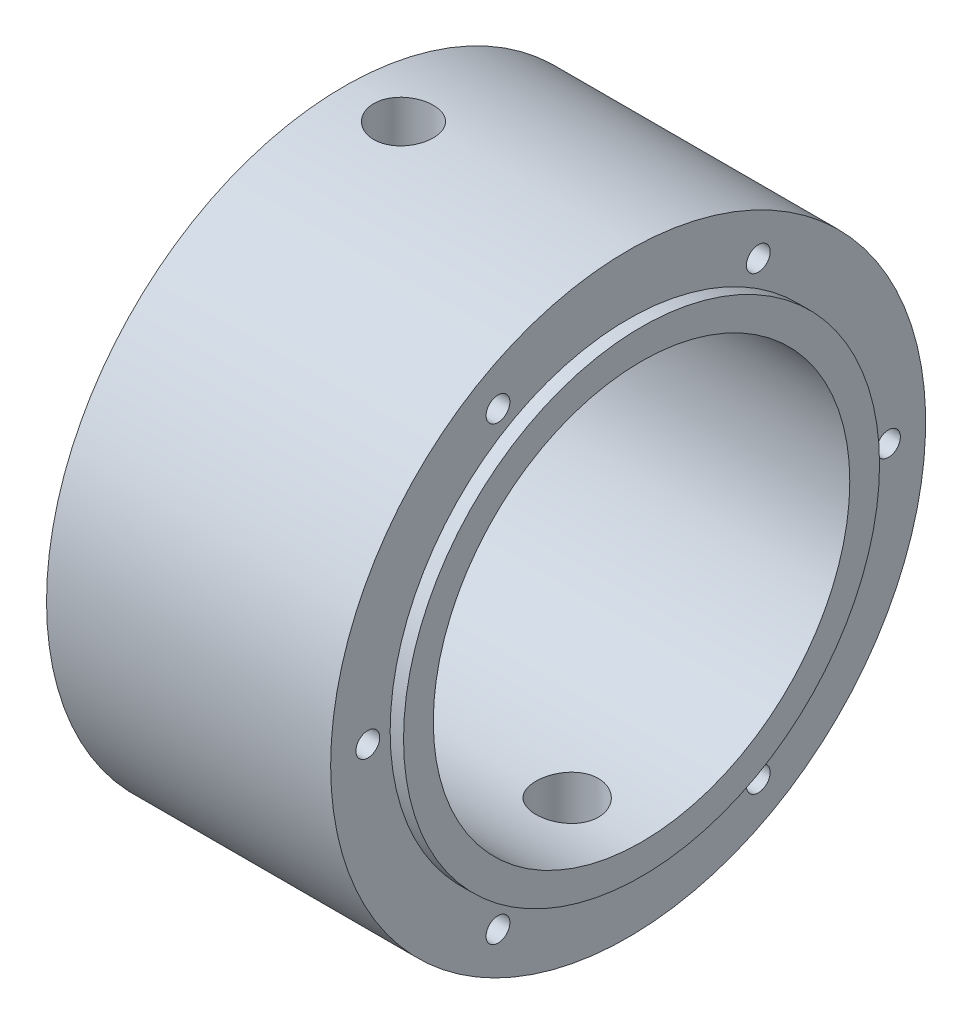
ISO-10303-21;
HEADER;
FILE_DESCRIPTION(('STEP AP214'),'2;1');
FILE_NAME('part.step','',(''),(''),'','','');
FILE_SCHEMA(('AUTOMOTIVE_DESIGN { 1 0 10303 214 1 1 1 1 }'));
ENDSEC;
DATA;
#1=APPLICATION_CONTEXT('core data for automotive mechanical design processes');
#2=APPLICATION_PROTOCOL_DEFINITION('international standard','automotive_design',2000,#1);
#3=PRODUCT_CONTEXT('',#1,'mechanical');
#4=PRODUCT('Part','Part','',(#3));
#5=PRODUCT_RELATED_PRODUCT_CATEGORY('part','',(#4));
#6=PRODUCT_DEFINITION_FORMATION('','',#4);
#7=PRODUCT_DEFINITION_CONTEXT('part definition',#1,'design');
#8=PRODUCT_DEFINITION('design','',#6,#7);
#9=PRODUCT_DEFINITION_SHAPE('','',#8);
#10=(LENGTH_UNIT() NAMED_UNIT(*) SI_UNIT(.MILLI.,.METRE.));
#11=(NAMED_UNIT(*) PLANE_ANGLE_UNIT() SI_UNIT($,.RADIAN.));
#12=(NAMED_UNIT(*) SI_UNIT($,.STERADIAN.) SOLID_ANGLE_UNIT());
#13=UNCERTAINTY_MEASURE_WITH_UNIT(LENGTH_MEASURE(1.E-05),#10,'distance_accuracy_value','');
#14=(GEOMETRIC_REPRESENTATION_CONTEXT(3) GLOBAL_UNCERTAINTY_ASSIGNED_CONTEXT((#13)) GLOBAL_UNIT_ASSIGNED_CONTEXT((#10,
#11,#12)) REPRESENTATION_CONTEXT('',''));
#15=CARTESIAN_POINT('',(0.,0.,0.));
#16=DIRECTION('',(0.,0.,1.));
#17=DIRECTION('',(1.,0.,0.));
#18=AXIS2_PLACEMENT_3D('',#15,#16,#17);
#19=CARTESIAN_POINT('',(0.,0.,0.));
#20=DIRECTION('',(-1.,0.,0.));
#21=DIRECTION('',(0.,0.,1.));
#22=AXIS2_PLACEMENT_3D('',#19,#20,#21);
#23=CYLINDRICAL_SURFACE('',#22,14.);
#24=CARTESIAN_POINT('',(15.,-13.8416039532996,-2.09999999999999));
#25=CARTESIAN_POINT('',(15.1172437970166,-13.8416059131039,-2.09999515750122));
#26=CARTESIAN_POINT('',(15.2345556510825,-13.8431097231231,-2.09014814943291));
#27=CARTESIAN_POINT('',(15.4658994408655,-13.8489584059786,-2.05103075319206));
#28=CARTESIAN_POINT('',(15.5799280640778,-13.8533060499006,-2.02174141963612));
#29=CARTESIAN_POINT('',(15.8013232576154,-13.8643391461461,-1.94463536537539));
#30=CARTESIAN_POINT('',(15.9086948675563,-13.8710228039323,-1.89683286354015));
#31=CARTESIAN_POINT('',(16.1138778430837,-13.8859727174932,-1.78409088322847));
#32=CARTESIAN_POINT('',(16.2116905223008,-13.8942387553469,-1.71915376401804));
#33=CARTESIAN_POINT('',(16.3957773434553,-13.9114960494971,-1.57343063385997));
#34=CARTESIAN_POINT('',(16.4819638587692,-13.9204920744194,-1.49253447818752));
#35=CARTESIAN_POINT('',(16.6395924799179,-13.9381531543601,-1.31742744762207));
#36=CARTESIAN_POINT('',(16.7110337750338,-13.9468181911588,-1.22321584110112));
#37=CARTESIAN_POINT('',(16.8374672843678,-13.9628908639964,-1.02359090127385));
#38=CARTESIAN_POINT('',(16.8923788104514,-13.9702922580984,-0.91812591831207));
#39=CARTESIAN_POINT('',(16.9836762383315,-13.9829508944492,-0.699340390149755));
#40=CARTESIAN_POINT('',(17.02006311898,-13.9882082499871,-0.586020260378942));
#41=CARTESIAN_POINT('',(17.0730127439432,-13.9959528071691,-0.355643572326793));
#42=CARTESIAN_POINT('',(17.089722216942,-13.9984605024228,-0.238621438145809));
#43=CARTESIAN_POINT('',(17.1032983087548,-14.0004934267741,-0.00340928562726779));
#44=CARTESIAN_POINT('',(17.1001660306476,-14.0000188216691,0.114780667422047));
#45=CARTESIAN_POINT('',(17.0742633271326,-13.9961569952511,0.347972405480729));
#46=CARTESIAN_POINT('',(17.0516507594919,-13.9927931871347,0.462992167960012));
#47=CARTESIAN_POINT('',(16.9876771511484,-13.9835570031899,0.687585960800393));
#48=CARTESIAN_POINT('',(16.946315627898,-13.9776845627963,0.797159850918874));
#49=CARTESIAN_POINT('',(16.8458566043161,-13.9640507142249,1.00822929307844));
#50=CARTESIAN_POINT('',(16.7866926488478,-13.9562822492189,1.10969274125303));
#51=CARTESIAN_POINT('',(16.652356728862,-13.9397221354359,1.30131107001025));
#52=CARTESIAN_POINT('',(16.5771837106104,-13.9309304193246,1.39146520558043));
#53=CARTESIAN_POINT('',(16.4120841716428,-13.9132022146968,1.5588362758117));
#54=CARTESIAN_POINT('',(16.3220198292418,-13.9042651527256,1.63591726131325));
#55=CARTESIAN_POINT('',(16.1301624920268,-13.8873378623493,1.77389239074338));
#56=CARTESIAN_POINT('',(16.0283694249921,-13.8793476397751,1.83478643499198));
#57=CARTESIAN_POINT('',(15.8158024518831,-13.865218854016,1.93867750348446));
#58=CARTESIAN_POINT('',(15.7050216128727,-13.8590817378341,1.98166055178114));
#59=CARTESIAN_POINT('',(15.4777006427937,-13.8493796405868,2.0483727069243));
#60=CARTESIAN_POINT('',(15.3611609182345,-13.8458144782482,2.07210317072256));
#61=CARTESIAN_POINT('',(15.1268398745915,-13.8416943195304,2.09945008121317));
#62=CARTESIAN_POINT('',(15.0090815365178,-13.841110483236,2.10325924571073));
#63=CARTESIAN_POINT('',(14.7746081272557,-13.8429425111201,2.09116679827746));
#64=CARTESIAN_POINT('',(14.6578930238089,-13.8453582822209,2.07526579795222));
#65=CARTESIAN_POINT('',(14.4294162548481,-13.8528908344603,2.02436784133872));
#66=CARTESIAN_POINT('',(14.3176327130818,-13.85799403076,1.98946689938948));
#67=CARTESIAN_POINT('',(14.101502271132,-13.8703152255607,1.90165964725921));
#68=CARTESIAN_POINT('',(13.9971557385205,-13.8775333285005,1.84875244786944));
#69=CARTESIAN_POINT('',(13.7979974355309,-13.8933389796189,1.72597149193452));
#70=CARTESIAN_POINT('',(13.7032633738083,-13.9019364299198,1.65597298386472));
#71=CARTESIAN_POINT('',(13.5268179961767,-13.919502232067,1.50116983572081));
#72=CARTESIAN_POINT('',(13.4451074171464,-13.9284706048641,1.41636435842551));
#73=CARTESIAN_POINT('',(13.296336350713,-13.9458578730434,1.23350586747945));
#74=CARTESIAN_POINT('',(13.2294035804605,-13.9542715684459,1.13534837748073));
#75=CARTESIAN_POINT('',(13.1129779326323,-13.9695206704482,0.929070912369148));
#76=CARTESIAN_POINT('',(13.063484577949,-13.9763561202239,0.820951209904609));
#77=CARTESIAN_POINT('',(12.9835467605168,-13.9876557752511,0.598217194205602));
#78=CARTESIAN_POINT('',(12.9530324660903,-13.9921286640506,0.48362840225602));
#79=CARTESIAN_POINT('',(12.9116929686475,-13.9982356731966,0.250881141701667));
#80=CARTESIAN_POINT('',(12.9008664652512,-13.9998699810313,0.132722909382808));
#81=CARTESIAN_POINT('',(12.8992416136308,-14.0001138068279,-0.102570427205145));
#82=CARTESIAN_POINT('',(12.9082478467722,-13.9987528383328,-0.219704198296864));
#83=CARTESIAN_POINT('',(12.9456139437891,-13.9932185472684,-0.45077171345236));
#84=CARTESIAN_POINT('',(12.9739737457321,-13.9890452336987,-0.564705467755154));
#85=CARTESIAN_POINT('',(13.0491726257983,-13.9783530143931,-0.786085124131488));
#86=CARTESIAN_POINT('',(13.0959981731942,-13.971835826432,-0.893535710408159));
#87=CARTESIAN_POINT('',(13.2067784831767,-13.9571716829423,-1.09908556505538));
#88=CARTESIAN_POINT('',(13.2707338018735,-13.9490246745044,-1.1971845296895));
#89=CARTESIAN_POINT('',(13.4146647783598,-13.9319111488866,-1.38223761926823));
#90=CARTESIAN_POINT('',(13.494784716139,-13.9229376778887,-1.46907889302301));
#91=CARTESIAN_POINT('',(13.6684671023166,-13.9052340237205,-1.62815531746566));
#92=CARTESIAN_POINT('',(13.7620327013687,-13.8965038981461,-1.70038703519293));
#93=CARTESIAN_POINT('',(13.9605685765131,-13.8802227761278,-1.82855835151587));
#94=CARTESIAN_POINT('',(14.0655999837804,-13.8726786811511,-1.88440412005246));
#95=CARTESIAN_POINT('',(14.283615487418,-13.8597047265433,-1.97757859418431));
#96=CARTESIAN_POINT('',(14.3965911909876,-13.8542726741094,-2.01492651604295));
#97=CARTESIAN_POINT('',(14.5917284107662,-13.8473927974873,-2.06156932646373));
#98=CARTESIAN_POINT('',(14.6726847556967,-13.8452334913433,-2.07595877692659));
#99=CARTESIAN_POINT('',(14.8357496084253,-13.8423383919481,-2.09517574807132));
#100=CARTESIAN_POINT('',(14.9178581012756,-13.8416025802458,-2.10000339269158));
#101=CARTESIAN_POINT('',(15.,-13.8416039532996,-2.09999999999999));
#102=B_SPLINE_CURVE_WITH_KNOTS('',3,(#24,#25,#26,#27,#28,#29,#30,#31,#32,#33,#34,#35,#36,#37,
#38,#39,#40,#41,#42,#43,#44,#45,#46,#47,#48,#49,#50,#51,#52,#53,#54,#55,#56,#57,#58,#59,#60,#61,
#62,#63,#64,#65,#66,#67,#68,#69,#70,#71,#72,#73,#74,#75,#76,#77,#78,#79,#80,#81,#82,#83,#84,#85,
#86,#87,#88,#89,#90,#91,#92,#93,#94,#95,#96,#97,#98,#99,#100,#101),.UNSPECIFIED.,.T.,.F.,(4,2,2,
2,2,2,2,2,2,2,2,2,2,2,2,2,2,2,2,2,2,2,2,2,2,2,2,2,2,2,2,2,2,2,2,2,2,2,4),(0.,0.351431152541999,
0.703205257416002,1.05470971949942,1.40616580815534,1.76013822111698,2.11413009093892,
2.46982290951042,2.82549693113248,3.17850165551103,3.5314867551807,3.88163807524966,
4.23179840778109,4.58328242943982,4.93478959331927,5.28975362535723,5.64471984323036,
5.9999625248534,6.35518016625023,6.70695500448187,7.05871892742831,7.40872152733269,
7.75874141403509,8.11139680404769,8.46407214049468,8.81968552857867,9.17528918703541,
9.5295765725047,9.88384055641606,10.234629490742,10.585417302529,10.9359485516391,
11.2864911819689,11.640313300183,11.9942184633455,12.3501123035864,12.7056356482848,
12.9518541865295,13.1980695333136),.UNSPECIFIED.);
#103=CARTESIAN_POINT('',(15.,-13.8416039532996,-2.09999999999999));
#104=VERTEX_POINT('',#103);
#105=EDGE_CURVE('E117',#104,#104,#102,.T.);
#106=ORIENTED_EDGE('',*,*,#105,.T.);
#107=EDGE_LOOP('',(#106));
#108=FACE_BOUND('',#107,.T.);
#109=CARTESIAN_POINT('',(4.,13.856406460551,2.00000000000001));
#110=CARTESIAN_POINT('',(4.11172417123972,13.8564082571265,1.9999953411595));
#111=CARTESIAN_POINT('',(4.22351471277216,13.8577723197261,1.99060664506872));
#112=CARTESIAN_POINT('',(4.4439746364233,13.8630779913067,1.95330740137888));
#113=CARTESIAN_POINT('',(4.55264079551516,13.8670221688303,1.92537839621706));
#114=CARTESIAN_POINT('',(4.76362870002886,13.8770324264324,1.85184738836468));
#115=CARTESIAN_POINT('',(4.86595507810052,13.8830969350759,1.8062584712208));
#116=CARTESIAN_POINT('',(5.06148972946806,13.8966626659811,1.69873175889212));
#117=CARTESIAN_POINT('',(5.1546993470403,13.9041636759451,1.63679637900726));
#118=CARTESIAN_POINT('',(5.33004829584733,13.9198182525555,1.49785346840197));
#119=CARTESIAN_POINT('',(5.41211171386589,13.9279757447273,1.4207505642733));
#120=CARTESIAN_POINT('',(5.56218155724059,13.9439890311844,1.25386707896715));
#121=CARTESIAN_POINT('',(5.63018723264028,13.9518448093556,1.16408582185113));
#122=CARTESIAN_POINT('',(5.75048909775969,13.9664103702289,0.973910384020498));
#123=CARTESIAN_POINT('',(5.80271571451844,13.9731150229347,0.873471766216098));
#124=CARTESIAN_POINT('',(5.88953073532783,13.9845795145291,0.665136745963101));
#125=CARTESIAN_POINT('',(5.9241199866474,13.9893394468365,0.557240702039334));
#126=CARTESIAN_POINT('',(5.97444920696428,13.9963505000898,0.337834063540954));
#127=CARTESIAN_POINT('',(5.99031606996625,13.9986185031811,0.22635312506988));
#128=CARTESIAN_POINT('',(6.00314389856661,14.0004479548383,0.00228956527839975));
#129=CARTESIAN_POINT('',(6.00010582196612,14.0000095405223,-0.110292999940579));
#130=CARTESIAN_POINT('',(5.9753106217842,13.9964890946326,-0.332498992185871));
#131=CARTESIAN_POINT('',(5.9536900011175,13.9934263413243,-0.442137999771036));
#132=CARTESIAN_POINT('',(5.8925574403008,13.9850228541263,-0.656215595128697));
#133=CARTESIAN_POINT('',(5.85304507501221,13.9796820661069,-0.760654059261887));
#134=CARTESIAN_POINT('',(5.75710925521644,13.9672894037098,-0.961781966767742));
#135=CARTESIAN_POINT('',(5.70062784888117,13.9602316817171,-1.05844339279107));
#136=CARTESIAN_POINT('',(5.57239950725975,13.9451926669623,-1.24096782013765));
#137=CARTESIAN_POINT('',(5.50065165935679,13.9372113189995,-1.32683017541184));
#138=CARTESIAN_POINT('',(5.34316539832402,13.921132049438,-1.48612299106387));
#139=CARTESIAN_POINT('',(5.25730786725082,13.9130337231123,-1.55943569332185));
#140=CARTESIAN_POINT('',(5.07444547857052,13.8977029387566,-1.69062989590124));
#141=CARTESIAN_POINT('',(4.97744056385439,13.890470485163,-1.74851131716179));
#142=CARTESIAN_POINT('',(4.77491971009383,13.8776905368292,-1.84721301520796));
#143=CARTESIAN_POINT('',(4.6693981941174,13.8721441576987,-1.88802200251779));
#144=CARTESIAN_POINT('',(4.45290242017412,13.8633846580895,-1.95130623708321));
#145=CARTESIAN_POINT('',(4.34192850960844,13.8601713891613,-1.97378265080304));
#146=CARTESIAN_POINT('',(4.11872346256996,13.8564698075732,-1.99960390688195));
#147=CARTESIAN_POINT('',(4.00651197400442,13.8559577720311,-2.00311531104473));
#148=CARTESIAN_POINT('',(3.78310219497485,13.8576537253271,-1.99134808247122));
#149=CARTESIAN_POINT('',(3.67190387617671,13.8598616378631,-1.97606997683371));
#150=CARTESIAN_POINT('',(3.45418781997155,13.8667269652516,-1.92729837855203));
#151=CARTESIAN_POINT('',(3.34765127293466,13.8713733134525,-1.89388715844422));
#152=CARTESIAN_POINT('',(3.1416912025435,13.8825829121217,-1.80988306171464));
#153=CARTESIAN_POINT('',(3.04226800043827,13.8891462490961,-1.75928940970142));
#154=CARTESIAN_POINT('',(2.85260812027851,13.9035064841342,-1.64195360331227));
#155=CARTESIAN_POINT('',(2.76243903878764,13.911311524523,-1.57510320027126));
#156=CARTESIAN_POINT('',(2.59454027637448,13.9272509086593,-1.42730277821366));
#157=CARTESIAN_POINT('',(2.51681123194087,13.9353852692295,-1.34635203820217));
#158=CARTESIAN_POINT('',(2.37540478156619,13.9511405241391,-1.17191708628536));
#159=CARTESIAN_POINT('',(2.31183747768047,13.9587570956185,-1.07834317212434));
#160=CARTESIAN_POINT('',(2.20132443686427,13.972552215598,-0.8817487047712));
#161=CARTESIAN_POINT('',(2.15437828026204,13.9787308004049,-0.778728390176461));
#162=CARTESIAN_POINT('',(2.07861788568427,13.9889347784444,-0.566515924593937));
#163=CARTESIAN_POINT('',(2.0497424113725,13.9929674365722,-0.457345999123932));
#164=CARTESIAN_POINT('',(2.01074453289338,13.9984555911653,-0.235645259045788));
#165=CARTESIAN_POINT('',(2.00062101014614,13.9999112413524,-0.12311464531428));
#166=CARTESIAN_POINT('',(1.99943976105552,14.0000800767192,0.101043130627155));
#167=CARTESIAN_POINT('',(2.00821318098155,13.9988175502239,0.212669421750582));
#168=CARTESIAN_POINT('',(2.04421615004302,13.9937406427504,0.432842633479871));
#169=CARTESIAN_POINT('',(2.07144565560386,13.989926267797,0.541389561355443));
#170=CARTESIAN_POINT('',(2.14352997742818,13.9801722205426,0.752283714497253));
#171=CARTESIAN_POINT('',(2.18837418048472,13.9742338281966,0.854634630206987));
#172=CARTESIAN_POINT('',(2.29439714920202,13.9608856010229,1.05038570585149));
#173=CARTESIAN_POINT('',(2.3555763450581,13.9534757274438,1.14378562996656));
#174=CARTESIAN_POINT('',(2.49314771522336,13.9379304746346,1.31984194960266));
#175=CARTESIAN_POINT('',(2.56966490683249,13.9297894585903,1.40240016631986));
#176=CARTESIAN_POINT('',(2.73547756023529,13.9137422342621,1.55356716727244));
#177=CARTESIAN_POINT('',(2.82477602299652,13.9058360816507,1.62217266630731));
#178=CARTESIAN_POINT('',(3.01414543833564,13.8911108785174,1.74379523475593));
#179=CARTESIAN_POINT('',(3.11426869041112,13.8842975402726,1.79673154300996));
#180=CARTESIAN_POINT('',(3.32203229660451,13.8725962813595,1.88495902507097));
#181=CARTESIAN_POINT('',(3.42966459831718,13.8677063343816,1.92026877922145));
#182=CARTESIAN_POINT('',(3.61483642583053,13.8615529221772,1.96409255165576));
#183=CARTESIAN_POINT('',(3.69122433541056,13.859633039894,1.97753762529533));
#184=CARTESIAN_POINT('',(3.84506419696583,13.857059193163,1.99549291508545));
#185=CARTESIAN_POINT('',(3.92251613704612,13.8564052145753,2.00000323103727));
#186=CARTESIAN_POINT('',(4.,13.856406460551,2.00000000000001));
#187=B_SPLINE_CURVE_WITH_KNOTS('',3,(#109,#110,#111,#112,#113,#114,#115,#116,#117,#118,#119,
#120,#121,#122,#123,#124,#125,#126,#127,#128,#129,#130,#131,#132,#133,#134,#135,#136,#137,#138,
#139,#140,#141,#142,#143,#144,#145,#146,#147,#148,#149,#150,#151,#152,#153,#154,#155,#156,#157,
#158,#159,#160,#161,#162,#163,#164,#165,#166,#167,#168,#169,#170,#171,#172,#173,#174,#175,#176,
#177,#178,#179,#180,#181,#182,#183,#184,#185,#186),.UNSPECIFIED.,.T.,.F.,(4,2,2,2,2,2,2,2,2,2,2,
2,2,2,2,2,2,2,2,2,2,2,2,2,2,2,2,2,2,2,2,2,2,2,2,2,2,2,4),(0.,0.334889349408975,
0.670112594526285,1.00508792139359,1.34001378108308,1.6771171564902,2.01423851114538,
2.35282530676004,2.69139583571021,3.02765822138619,3.36390357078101,3.69769984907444,
4.03150405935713,4.36646147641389,4.70143892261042,5.03940517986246,5.37737316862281,
5.71556429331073,6.05373389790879,6.38892861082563,6.72411392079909,7.05779100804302,
7.39148315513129,7.72746121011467,8.06345644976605,8.40197921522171,8.74049343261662,
9.07785422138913,9.41519488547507,9.7495337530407,10.0838718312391,10.4180087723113,
10.7521545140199,11.0891434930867,11.426211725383,11.7649881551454,12.103406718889,
12.3356645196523,12.5679197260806),.UNSPECIFIED.);
#188=CARTESIAN_POINT('',(4.,13.856406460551,2.00000000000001));
#189=VERTEX_POINT('',#188);
#190=EDGE_CURVE('E195',#189,#189,#187,.T.);
#191=ORIENTED_EDGE('',*,*,#190,.T.);
#192=EDGE_LOOP('',(#191));
#193=FACE_BOUND('',#192,.T.);
#194=CARTESIAN_POINT('',(20.,0.,0.));
#195=DIRECTION('',(-1.,0.,0.));
#196=DIRECTION('',(0.,0.,1.));
#197=AXIS2_PLACEMENT_3D('',#194,#195,#196);
#198=CIRCLE('',#197,14.);
#199=CARTESIAN_POINT('',(20.,0.,14.));
#200=VERTEX_POINT('',#199);
#201=EDGE_CURVE('E199',#200,#200,#198,.T.);
#202=ORIENTED_EDGE('',*,*,#201,.F.);
#203=EDGE_LOOP('',(#202));
#204=FACE_BOUND('',#203,.T.);
#205=CARTESIAN_POINT('',(0.,0.,0.));
#206=DIRECTION('',(-1.,0.,0.));
#207=DIRECTION('',(0.,0.,1.));
#208=AXIS2_PLACEMENT_3D('',#205,#206,#207);
#209=CIRCLE('',#208,14.);
#210=CARTESIAN_POINT('',(0.,0.,14.));
#211=VERTEX_POINT('',#210);
#212=EDGE_CURVE('E11',#211,#211,#209,.T.);
#213=ORIENTED_EDGE('',*,*,#212,.T.);
#214=EDGE_LOOP('',(#213));
#215=FACE_BOUND('',#214,.T.);
#216=ADVANCED_FACE('F29',(#108,#193,#204,#215),#23,.F.);
#217=CARTESIAN_POINT('',(0.,14.,0.));
#218=DIRECTION('',(1.,0.,0.));
#219=DIRECTION('',(0.,0.,-1.));
#220=AXIS2_PLACEMENT_3D('',#217,#218,#219);
#221=PLANE('',#220);
#222=ORIENTED_EDGE('',*,*,#212,.F.);
#223=EDGE_LOOP('',(#222));
#224=FACE_BOUND('',#223,.T.);
#225=CARTESIAN_POINT('',(0.,0.,0.));
#226=DIRECTION('',(-1.,0.,0.));
#227=DIRECTION('',(0.,0.,1.));
#228=AXIS2_PLACEMENT_3D('',#225,#226,#227);
#229=CIRCLE('',#228,20.);
#230=CARTESIAN_POINT('',(0.,0.,20.));
#231=VERTEX_POINT('',#230);
#232=EDGE_CURVE('E36',#231,#231,#229,.T.);
#233=ORIENTED_EDGE('',*,*,#232,.T.);
#234=EDGE_LOOP('',(#233));
#235=FACE_BOUND('',#234,.T.);
#236=ADVANCED_FACE('F183',(#224,#235),#221,.F.);
#237=CARTESIAN_POINT('',(0.,0.,0.));
#238=DIRECTION('',(-1.,0.,0.));
#239=DIRECTION('',(0.,0.,1.));
#240=AXIS2_PLACEMENT_3D('',#237,#238,#239);
#241=CYLINDRICAL_SURFACE('',#240,20.);
#242=CARTESIAN_POINT('',(15.,-19.8894444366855,-2.09999999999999));
#243=CARTESIAN_POINT('',(14.8823914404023,-19.8894458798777,-2.09999492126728));
#244=CARTESIAN_POINT('',(14.7647058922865,-19.8904988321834,-2.09008687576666));
#245=CARTESIAN_POINT('',(14.5325999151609,-19.894596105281,-2.05071267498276));
#246=CARTESIAN_POINT('',(14.4181831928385,-19.8976425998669,-2.02122516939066));
#247=CARTESIAN_POINT('',(14.1960095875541,-19.9053781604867,-1.94356213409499));
#248=CARTESIAN_POINT('',(14.0882486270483,-19.9100662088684,-1.89539818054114));
#249=CARTESIAN_POINT('',(13.8823627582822,-19.9205554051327,-1.78177217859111));
#250=CARTESIAN_POINT('',(13.7842359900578,-19.9263563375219,-1.71631347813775));
#251=CARTESIAN_POINT('',(13.5999893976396,-19.9384436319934,-1.56967546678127));
#252=CARTESIAN_POINT('',(13.5139134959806,-19.944731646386,-1.48844109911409));
#253=CARTESIAN_POINT('',(13.3565904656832,-19.9570696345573,-1.31267556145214));
#254=CARTESIAN_POINT('',(13.2853440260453,-19.963119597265,-1.21814377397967));
#255=CARTESIAN_POINT('',(13.1595492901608,-19.974316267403,-1.01819621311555));
#256=CARTESIAN_POINT('',(13.1050400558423,-19.9794608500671,-0.912755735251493));
#257=CARTESIAN_POINT('',(13.0145169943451,-19.9882490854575,-0.69415512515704));
#258=CARTESIAN_POINT('',(12.9785026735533,-19.9918927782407,-0.580995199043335));
#259=CARTESIAN_POINT('',(12.9261210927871,-19.9972570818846,-0.350612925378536));
#260=CARTESIAN_POINT('',(12.9096814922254,-19.9989847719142,-0.233407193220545));
#261=CARTESIAN_POINT('',(12.8966921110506,-20.0003465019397,0.00211161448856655));
#262=CARTESIAN_POINT('',(12.9001417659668,-19.9999806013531,0.120424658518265));
#263=CARTESIAN_POINT('',(12.9267743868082,-19.9972021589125,0.354308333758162));
#264=CARTESIAN_POINT('',(12.9498795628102,-19.9947976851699,0.46988793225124));
#265=CARTESIAN_POINT('',(13.0150460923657,-19.9882215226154,0.695519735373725));
#266=CARTESIAN_POINT('',(13.057107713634,-19.9840498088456,0.805571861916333));
#267=CARTESIAN_POINT('',(13.1590779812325,-19.9743942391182,1.01726915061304));
#268=CARTESIAN_POINT('',(13.2190209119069,-19.9689078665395,1.11889767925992));
#269=CARTESIAN_POINT('',(13.3550273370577,-19.9572382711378,1.31068142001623));
#270=CARTESIAN_POINT('',(13.4310913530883,-19.9510550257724,1.40083626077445));
#271=CARTESIAN_POINT('',(13.5976179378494,-19.9386500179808,1.5675693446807));
#272=CARTESIAN_POINT('',(13.688148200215,-19.9324282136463,1.64407999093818));
#273=CARTESIAN_POINT('',(13.8808031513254,-19.9206770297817,1.78082912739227));
#274=CARTESIAN_POINT('',(13.9829278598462,-19.9151476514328,1.84106758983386));
#275=CARTESIAN_POINT('',(14.1959262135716,-19.9054069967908,1.94356284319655));
#276=CARTESIAN_POINT('',(14.3068019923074,-19.9011960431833,1.98581523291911));
#277=CARTESIAN_POINT('',(14.5341284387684,-19.8945756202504,2.05108428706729));
#278=CARTESIAN_POINT('',(14.6505789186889,-19.8921660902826,2.07410159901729));
#279=CARTESIAN_POINT('',(14.8851550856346,-19.8894319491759,2.10015970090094));
#280=CARTESIAN_POINT('',(15.0032701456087,-19.8890974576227,2.10329516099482));
#281=CARTESIAN_POINT('',(15.2383439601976,-19.8905251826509,2.08974939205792));
#282=CARTESIAN_POINT('',(15.3553027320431,-19.8922873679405,2.07306845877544));
#283=CARTESIAN_POINT('',(15.584466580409,-19.8977008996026,2.02044271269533));
#284=CARTESIAN_POINT('',(15.6966820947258,-19.901347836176,1.98454285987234));
#285=CARTESIAN_POINT('',(15.9134988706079,-19.9101163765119,1.8945443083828));
#286=CARTESIAN_POINT('',(16.0180999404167,-19.9152380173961,1.84044515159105));
#287=CARTESIAN_POINT('',(16.2171495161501,-19.9264027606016,1.7153473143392));
#288=CARTESIAN_POINT('',(16.311558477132,-19.9324492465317,1.64428601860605));
#289=CARTESIAN_POINT('',(16.4871424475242,-19.9447714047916,1.48737059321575));
#290=CARTESIAN_POINT('',(16.5683170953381,-19.9510470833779,1.40151605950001));
#291=CARTESIAN_POINT('',(16.7154557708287,-19.9631504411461,1.21704002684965));
#292=CARTESIAN_POINT('',(16.781357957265,-19.9689762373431,1.1183690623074));
#293=CARTESIAN_POINT('',(16.8956550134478,-19.9794958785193,0.911304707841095));
#294=CARTESIAN_POINT('',(16.9440501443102,-19.984189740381,0.802911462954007));
#295=CARTESIAN_POINT('',(17.021855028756,-19.9919081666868,0.579693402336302));
#296=CARTESIAN_POINT('',(17.0513018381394,-19.9949359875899,0.464881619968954));
#297=CARTESIAN_POINT('',(17.0904950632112,-19.9989945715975,0.231909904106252));
#298=CARTESIAN_POINT('',(17.1002420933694,-20.0000253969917,0.113750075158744));
#299=CARTESIAN_POINT('',(17.0997499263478,-19.99997376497,-0.121956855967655));
#300=CARTESIAN_POINT('',(17.0896066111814,-19.9989014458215,-0.239504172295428));
#301=CARTESIAN_POINT('',(17.0498231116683,-19.9947840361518,-0.47121487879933));
#302=CARTESIAN_POINT('',(17.0201829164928,-19.9917389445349,-0.585378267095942));
#303=CARTESIAN_POINT('',(16.9422742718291,-19.9840170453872,-0.807077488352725));
#304=CARTESIAN_POINT('',(16.8940089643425,-19.9793405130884,-0.914614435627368));
#305=CARTESIAN_POINT('',(16.7802302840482,-19.9688763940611,-1.12007619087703));
#306=CARTESIAN_POINT('',(16.7147169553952,-19.963088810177,-1.21800102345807));
#307=CARTESIAN_POINT('',(16.5679430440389,-19.9510171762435,-1.40195004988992));
#308=CARTESIAN_POINT('',(16.4866110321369,-19.9447309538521,-1.48791710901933));
#309=CARTESIAN_POINT('',(16.3106514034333,-19.9323887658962,-1.64502445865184));
#310=CARTESIAN_POINT('',(16.2160206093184,-19.9263328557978,-1.71616119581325));
#311=CARTESIAN_POINT('',(16.0158588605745,-19.9151189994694,-1.84174748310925));
#312=CARTESIAN_POINT('',(15.9102983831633,-19.9099635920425,-1.89615017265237));
#313=CARTESIAN_POINT('',(15.6915522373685,-19.901164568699,-1.98638439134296));
#314=CARTESIAN_POINT('',(15.5783752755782,-19.897519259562,-2.02223673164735));
#315=CARTESIAN_POINT('',(15.3871392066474,-19.8930662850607,-2.06547664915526));
#316=CARTESIAN_POINT('',(15.3102999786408,-19.8917145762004,-2.07840504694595));
#317=CARTESIAN_POINT('',(15.1556517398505,-19.8899031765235,-2.09566838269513));
#318=CARTESIAN_POINT('',(15.0778427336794,-19.8894434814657,-2.10000336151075));
#319=CARTESIAN_POINT('',(15.,-19.8894444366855,-2.09999999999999));
#320=B_SPLINE_CURVE_WITH_KNOTS('',3,(#242,#243,#244,#245,#246,#247,#248,#249,#250,#251,#252,
#253,#254,#255,#256,#257,#258,#259,#260,#261,#262,#263,#264,#265,#266,#267,#268,#269,#270,#271,
#272,#273,#274,#275,#276,#277,#278,#279,#280,#281,#282,#283,#284,#285,#286,#287,#288,#289,#290,
#291,#292,#293,#294,#295,#296,#297,#298,#299,#300,#301,#302,#303,#304,#305,#306,#307,#308,#309,
#310,#311,#312,#313,#314,#315,#316,#317,#318,#319),.UNSPECIFIED.,.T.,.F.,(4,2,2,2,2,2,2,2,2,2,2,
2,2,2,2,2,2,2,2,2,2,2,2,2,2,2,2,2,2,2,2,2,2,2,2,2,2,2,4),(0.,0.352541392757,0.705467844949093,
1.05817589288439,1.41081571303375,1.76470910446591,2.11861893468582,2.47334856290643,
2.82806872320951,3.18147386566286,3.53486897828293,3.88687194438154,4.23887988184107,
4.59156712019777,4.94426577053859,5.29866597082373,5.65306677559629,6.00755425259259,
6.36202979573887,6.71481617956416,7.06759729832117,7.41955671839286,7.77152499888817,
8.12481322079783,8.47811109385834,8.83281547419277,9.18751456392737,9.54151787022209,
9.8955101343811,10.2478001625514,10.6000903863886,10.9523212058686,11.3045511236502,
11.6584100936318,12.0123537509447,12.3672797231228,12.7218066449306,12.9551477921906,
13.188487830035),.UNSPECIFIED.);
#321=CARTESIAN_POINT('',(17.1,-20.,0.));
#322=VERTEX_POINT('',#321);
#323=CARTESIAN_POINT('',(12.9,-20.,0.));
#324=VERTEX_POINT('',#323);
#325=EDGE_CURVE('E124',#322,#324,#320,.T.);
#326=ORIENTED_EDGE('',*,*,#325,.T.);
#327=EDGE_CURVE('E42',#324,#322,#320,.T.);
#328=ORIENTED_EDGE('',*,*,#327,.T.);
#329=EDGE_LOOP('',(#326,#328));
#330=FACE_BOUND('',#329,.T.);
#331=CARTESIAN_POINT('',(4.,19.8997487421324,2.00000000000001));
#332=CARTESIAN_POINT('',(3.88796087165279,19.8997500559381,1.99999514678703));
#333=CARTESIAN_POINT('',(3.77584766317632,19.9007051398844,1.99055371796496));
#334=CARTESIAN_POINT('',(3.55472962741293,19.9044217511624,1.95303262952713));
#335=CARTESIAN_POINT('',(3.44572836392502,19.9071852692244,1.92493242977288));
#336=CARTESIAN_POINT('',(3.23406836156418,19.9142026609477,1.85092023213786));
#337=CARTESIAN_POINT('',(3.13140582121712,19.9184556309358,1.80501903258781));
#338=CARTESIAN_POINT('',(2.9352644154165,19.9279716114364,1.69672853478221));
#339=CARTESIAN_POINT('',(2.84178373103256,19.9332344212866,1.63434251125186));
#340=CARTESIAN_POINT('',(2.666297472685,19.944198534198,1.49460952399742));
#341=CARTESIAN_POINT('',(2.58432998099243,19.9499012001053,1.41721483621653));
#342=CARTESIAN_POINT('',(2.43452478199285,19.9610901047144,1.24976343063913));
#343=CARTESIAN_POINT('',(2.36668772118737,19.9665763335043,1.15970613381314));
#344=CARTESIAN_POINT('',(2.24693748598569,19.9767276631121,0.969252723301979));
#345=CARTESIAN_POINT('',(2.19505800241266,19.9813910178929,0.868835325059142));
#346=CARTESIAN_POINT('',(2.10891113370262,19.9893563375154,0.660659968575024));
#347=CARTESIAN_POINT('',(2.07464331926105,19.9926583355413,0.55290218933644));
#348=CARTESIAN_POINT('',(2.02480418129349,19.9975193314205,0.333489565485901));
#349=CARTESIAN_POINT('',(2.0091703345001,19.9990841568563,0.221849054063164));
#350=CARTESIAN_POINT('',(1.99684946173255,20.0003143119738,-0.00248148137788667));
#351=CARTESIAN_POINT('',(2.00016194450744,19.9999796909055,-0.115171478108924));
#352=CARTESIAN_POINT('',(2.0255889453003,19.9974534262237,-0.337977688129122));
#353=CARTESIAN_POINT('',(2.04763623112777,19.9952684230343,-0.448101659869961));
#354=CARTESIAN_POINT('',(2.10980225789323,19.9892945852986,-0.66307835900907));
#355=CARTESIAN_POINT('',(2.14992123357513,19.9855057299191,-0.767931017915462));
#356=CARTESIAN_POINT('',(2.24716552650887,19.9767387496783,-0.969600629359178));
#357=CARTESIAN_POINT('',(2.30432059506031,19.9717585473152,-1.06640314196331));
#358=CARTESIAN_POINT('',(2.43399304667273,19.9611676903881,-1.24906702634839));
#359=CARTESIAN_POINT('',(2.50651088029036,19.9555570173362,-1.33492807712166));
#360=CARTESIAN_POINT('',(2.66522845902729,19.944305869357,-1.49366554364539));
#361=CARTESIAN_POINT('',(2.75148668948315,19.9386653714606,-1.5664834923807));
#362=CARTESIAN_POINT('',(2.93503373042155,19.9280147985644,-1.69661507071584));
#363=CARTESIAN_POINT('',(3.03232255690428,19.9230047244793,-1.75392867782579));
#364=CARTESIAN_POINT('',(3.23521405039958,19.914181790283,-1.85142436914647));
#365=CARTESIAN_POINT('',(3.34081846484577,19.9103691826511,-1.89160284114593));
#366=CARTESIAN_POINT('',(3.55732120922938,19.9043780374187,-1.95364147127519));
#367=CARTESIAN_POINT('',(3.66821937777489,19.9021994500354,-1.97550218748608));
#368=CARTESIAN_POINT('',(3.89164835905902,19.8997316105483,-2.00020955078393));
#369=CARTESIAN_POINT('',(4.00417004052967,19.8994342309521,-2.00313799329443));
#370=CARTESIAN_POINT('',(4.22810253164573,19.9007410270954,-1.99011249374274));
#371=CARTESIAN_POINT('',(4.33951335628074,19.9023451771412,-1.97415880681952));
#372=CARTESIAN_POINT('',(4.55782316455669,19.907266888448,-1.92389034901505));
#373=CARTESIAN_POINT('',(4.66473114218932,19.9105808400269,-1.88961425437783));
#374=CARTESIAN_POINT('',(4.87128010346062,19.9185458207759,-1.80371343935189));
#375=CARTESIAN_POINT('',(4.97092092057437,19.9231968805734,-1.75208832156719));
#376=CARTESIAN_POINT('',(5.16047994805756,19.9333316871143,-1.63275000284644));
#377=CARTESIAN_POINT('',(5.25036388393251,19.9388182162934,-1.56498259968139));
#378=CARTESIAN_POINT('',(5.41751010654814,19.9499966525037,-1.41536106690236));
#379=CARTESIAN_POINT('',(5.49477208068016,19.9556885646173,-1.33350658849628));
#380=CARTESIAN_POINT('',(5.63476326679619,19.966660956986,-1.15767960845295));
#381=CARTESIAN_POINT('',(5.69743911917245,19.9719398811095,-1.06366451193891));
#382=CARTESIAN_POINT('',(5.80611173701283,19.9814688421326,-0.866395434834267));
#383=CARTESIAN_POINT('',(5.85210873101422,19.9857188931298,-0.763141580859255));
#384=CARTESIAN_POINT('',(5.92602753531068,19.9927042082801,-0.550512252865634));
#385=CARTESIAN_POINT('',(5.95398157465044,19.995442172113,-0.441148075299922));
#386=CARTESIAN_POINT('',(5.9911261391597,19.999105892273,-0.21924962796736));
#387=CARTESIAN_POINT('',(6.00031719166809,20.0000316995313,-0.106715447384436));
#388=CARTESIAN_POINT('',(5.99966746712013,19.9999667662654,0.117804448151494));
#389=CARTESIAN_POINT('',(5.9899095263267,19.9989843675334,0.229790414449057));
#390=CARTESIAN_POINT('',(5.95181250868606,19.9952298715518,0.450523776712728));
#391=CARTESIAN_POINT('',(5.92347341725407,19.9924577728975,0.559271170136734));
#392=CARTESIAN_POINT('',(5.84904148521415,19.9854344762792,0.770439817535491));
#393=CARTESIAN_POINT('',(5.80295106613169,19.981183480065,0.872861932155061));
#394=CARTESIAN_POINT('',(5.69433366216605,19.9716762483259,1.0685292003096));
#395=CARTESIAN_POINT('',(5.63180677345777,19.9664200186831,1.16177440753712));
#396=CARTESIAN_POINT('',(5.49178076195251,19.9554636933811,1.33686544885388));
#397=CARTESIAN_POINT('',(5.41421996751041,19.949761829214,1.41866185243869));
#398=CARTESIAN_POINT('',(5.24644929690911,19.9385718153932,1.56811551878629));
#399=CARTESIAN_POINT('',(5.15623638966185,19.9330837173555,1.6357693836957));
#400=CARTESIAN_POINT('',(4.96547131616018,19.922927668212,1.75515328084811));
#401=CARTESIAN_POINT('',(4.8648934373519,19.9182618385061,1.80684237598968));
#402=CARTESIAN_POINT('',(4.65650341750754,19.9103038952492,1.89252941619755));
#403=CARTESIAN_POINT('',(4.54869959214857,19.9070102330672,1.92654731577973));
#404=CARTESIAN_POINT('',(4.36690451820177,19.9030001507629,1.96744337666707));
#405=CARTESIAN_POINT('',(4.29407549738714,19.9017866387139,1.97963542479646));
#406=CARTESIAN_POINT('',(4.14750835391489,19.9001605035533,1.99591531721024));
#407=CARTESIAN_POINT('',(4.07377023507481,19.8997478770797,2.00000319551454));
#408=CARTESIAN_POINT('',(4.,19.8997487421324,2.00000000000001));
#409=B_SPLINE_CURVE_WITH_KNOTS('',3,(#331,#332,#333,#334,#335,#336,#337,#338,#339,#340,#341,
#342,#343,#344,#345,#346,#347,#348,#349,#350,#351,#352,#353,#354,#355,#356,#357,#358,#359,#360,
#361,#362,#363,#364,#365,#366,#367,#368,#369,#370,#371,#372,#373,#374,#375,#376,#377,#378,#379,
#380,#381,#382,#383,#384,#385,#386,#387,#388,#389,#390,#391,#392,#393,#394,#395,#396,#397,#398,
#399,#400,#401,#402,#403,#404,#405,#406,#407,#408),.UNSPECIFIED.,.T.,.F.,(4,2,2,2,2,2,2,2,2,2,2,
2,2,2,2,2,2,2,2,2,2,2,2,2,2,2,2,2,2,2,2,2,2,2,2,2,2,2,4),(0.,0.335847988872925,
0.672066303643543,1.00808098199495,1.34402896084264,1.68106323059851,2.01811291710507,
2.35586939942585,2.69361764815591,3.03022941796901,3.36683245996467,3.70223263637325,
4.03763716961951,4.37363090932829,4.7096345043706,5.04710850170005,5.38458298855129,
5.7221285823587,6.05966389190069,6.39573992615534,6.73181141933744,7.06717629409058,
7.40254885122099,7.7390637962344,8.0755870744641,8.41332273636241,8.75105377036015,
9.08817985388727,9.42529646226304,9.76094266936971,10.0965891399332,10.432189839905,
10.767788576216,11.1047943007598,11.4418809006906,11.7798248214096,12.1173862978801,
12.338520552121,12.5596538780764),.UNSPECIFIED.);
#410=CARTESIAN_POINT('',(6.00000000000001,20.,0.));
#411=VERTEX_POINT('',#410);
#412=CARTESIAN_POINT('',(1.99999999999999,20.,0.));
#413=VERTEX_POINT('',#412);
#414=EDGE_CURVE('E216',#411,#413,#409,.T.);
#415=ORIENTED_EDGE('',*,*,#414,.T.);
#416=EDGE_CURVE('E49',#413,#411,#409,.T.);
#417=ORIENTED_EDGE('',*,*,#416,.T.);
#418=EDGE_LOOP('',(#415,#417));
#419=FACE_BOUND('',#418,.T.);
#420=ORIENTED_EDGE('',*,*,#232,.F.);
#421=EDGE_LOOP('',(#420));
#422=FACE_BOUND('',#421,.T.);
#423=CARTESIAN_POINT('',(19.1,0.,0.));
#424=DIRECTION('',(-1.,0.,0.));
#425=DIRECTION('',(0.,0.,1.));
#426=AXIS2_PLACEMENT_3D('',#423,#424,#425);
#427=CIRCLE('',#426,20.);
#428=CARTESIAN_POINT('',(19.1,0.,20.));
#429=VERTEX_POINT('',#428);
#430=EDGE_CURVE('E205',#429,#429,#427,.T.);
#431=ORIENTED_EDGE('',*,*,#430,.T.);
#432=EDGE_LOOP('',(#431));
#433=FACE_BOUND('',#432,.T.);
#434=ADVANCED_FACE('F188',(#330,#419,#422,#433),#241,.T.);
#435=CARTESIAN_POINT('',(19.1,20.,0.));
#436=DIRECTION('',(-1.,0.,0.));
#437=DIRECTION('',(0.,0.,1.));
#438=AXIS2_PLACEMENT_3D('',#435,#436,#437);
#439=PLANE('',#438);
#440=CARTESIAN_POINT('',(19.1,-15.1554445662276,8.75000000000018));
#441=DIRECTION('',(1.,0.,0.));
#442=DIRECTION('',(0.,0.,-1.));
#443=AXIS2_PLACEMENT_3D('',#440,#441,#442);
#444=CIRCLE('',#443,0.79999999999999);
#445=CARTESIAN_POINT('',(19.1,-15.1554445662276,7.95000000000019));
#446=VERTEX_POINT('',#445);
#447=EDGE_CURVE('E82',#446,#446,#444,.T.);
#448=ORIENTED_EDGE('',*,*,#447,.F.);
#449=EDGE_LOOP('',(#448));
#450=FACE_BOUND('',#449,.T.);
#451=CARTESIAN_POINT('',(19.1,-15.1554445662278,-8.74999999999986));
#452=DIRECTION('',(1.,0.,0.));
#453=DIRECTION('',(0.,0.,-1.));
#454=AXIS2_PLACEMENT_3D('',#451,#452,#453);
#455=CIRCLE('',#454,0.79999999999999);
#456=CARTESIAN_POINT('',(19.1,-15.1554445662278,-9.54999999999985));
#457=VERTEX_POINT('',#456);
#458=EDGE_CURVE('E90',#457,#457,#455,.T.);
#459=ORIENTED_EDGE('',*,*,#458,.F.);
#460=EDGE_LOOP('',(#459));
#461=FACE_BOUND('',#460,.T.);
#462=CARTESIAN_POINT('',(19.1,-1.22201917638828E-13,-17.5));
#463=DIRECTION('',(1.,0.,0.));
#464=DIRECTION('',(0.,0.,-1.));
#465=AXIS2_PLACEMENT_3D('',#462,#463,#464);
#466=CIRCLE('',#465,0.79999999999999);
#467=CARTESIAN_POINT('',(19.1,-1.22201917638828E-13,-18.3));
#468=VERTEX_POINT('',#467);
#469=EDGE_CURVE('E96',#468,#468,#466,.T.);
#470=ORIENTED_EDGE('',*,*,#469,.F.);
#471=EDGE_LOOP('',(#470));
#472=FACE_BOUND('',#471,.T.);
#473=CARTESIAN_POINT('',(19.1,15.1554445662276,-8.75000000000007));
#474=DIRECTION('',(1.,0.,0.));
#475=DIRECTION('',(0.,0.,-1.));
#476=AXIS2_PLACEMENT_3D('',#473,#474,#475);
#477=CIRCLE('',#476,0.79999999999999);
#478=CARTESIAN_POINT('',(19.1,15.1554445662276,-9.55000000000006));
#479=VERTEX_POINT('',#478);
#480=EDGE_CURVE('E102',#479,#479,#477,.T.);
#481=ORIENTED_EDGE('',*,*,#480,.F.);
#482=EDGE_LOOP('',(#481));
#483=FACE_BOUND('',#482,.T.);
#484=CARTESIAN_POINT('',(19.1,15.1554445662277,8.74999999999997));
#485=DIRECTION('',(1.,0.,0.));
#486=DIRECTION('',(0.,0.,-1.));
#487=AXIS2_PLACEMENT_3D('',#484,#485,#486);
#488=CIRCLE('',#487,0.79999999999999);
#489=CARTESIAN_POINT('',(19.1,15.1554445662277,7.94999999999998));
#490=VERTEX_POINT('',#489);
#491=EDGE_CURVE('E108',#490,#490,#488,.T.);
#492=ORIENTED_EDGE('',*,*,#491,.F.);
#493=EDGE_LOOP('',(#492));
#494=FACE_BOUND('',#493,.T.);
#495=CARTESIAN_POINT('',(19.1,0.,17.5));
#496=DIRECTION('',(1.,0.,0.));
#497=DIRECTION('',(0.,0.,-1.));
#498=AXIS2_PLACEMENT_3D('',#495,#496,#497);
#499=CIRCLE('',#498,0.79999999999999);
#500=CARTESIAN_POINT('',(19.1,0.,16.7));
#501=VERTEX_POINT('',#500);
#502=EDGE_CURVE('E114',#501,#501,#499,.T.);
#503=ORIENTED_EDGE('',*,*,#502,.F.);
#504=EDGE_LOOP('',(#503));
#505=FACE_BOUND('',#504,.T.);
#506=ORIENTED_EDGE('',*,*,#430,.F.);
#507=EDGE_LOOP('',(#506));
#508=FACE_BOUND('',#507,.T.);
#509=CARTESIAN_POINT('',(19.1,0.,0.));
#510=DIRECTION('',(-1.,0.,0.));
#511=DIRECTION('',(0.,0.,1.));
#512=AXIS2_PLACEMENT_3D('',#509,#510,#511);
#513=CIRCLE('',#512,16.);
#514=CARTESIAN_POINT('',(19.1,0.,16.));
#515=VERTEX_POINT('',#514);
#516=EDGE_CURVE('E207',#515,#515,#513,.T.);
#517=ORIENTED_EDGE('',*,*,#516,.T.);
#518=EDGE_LOOP('',(#517));
#519=FACE_BOUND('',#518,.T.);
#520=ADVANCED_FACE('F236',(#450,#461,#472,#483,#494,#505,#508,#519),#439,.F.);
#521=CARTESIAN_POINT('',(0.,0.,0.));
#522=DIRECTION('',(-1.,0.,0.));
#523=DIRECTION('',(0.,0.,1.));
#524=AXIS2_PLACEMENT_3D('',#521,#522,#523);
#525=CYLINDRICAL_SURFACE('',#524,16.);
#526=ORIENTED_EDGE('',*,*,#516,.F.);
#527=EDGE_LOOP('',(#526));
#528=FACE_BOUND('',#527,.T.);
#529=CARTESIAN_POINT('',(20.,0.,0.));
#530=DIRECTION('',(-1.,0.,0.));
#531=DIRECTION('',(0.,0.,1.));
#532=AXIS2_PLACEMENT_3D('',#529,#530,#531);
#533=CIRCLE('',#532,16.);
#534=CARTESIAN_POINT('',(20.,0.,16.));
#535=VERTEX_POINT('',#534);
#536=EDGE_CURVE('E212',#535,#535,#533,.T.);
#537=ORIENTED_EDGE('',*,*,#536,.T.);
#538=EDGE_LOOP('',(#537));
#539=FACE_BOUND('',#538,.T.);
#540=ADVANCED_FACE('F233',(#528,#539),#525,.T.);
#541=CARTESIAN_POINT('',(20.,16.,0.));
#542=DIRECTION('',(-1.,0.,0.));
#543=DIRECTION('',(0.,0.,1.));
#544=AXIS2_PLACEMENT_3D('',#541,#542,#543);
#545=PLANE('',#544);
#546=ORIENTED_EDGE('',*,*,#536,.F.);
#547=EDGE_LOOP('',(#546));
#548=FACE_BOUND('',#547,.T.);
#549=ORIENTED_EDGE('',*,*,#201,.T.);
#550=EDGE_LOOP('',(#549));
#551=FACE_BOUND('',#550,.T.);
#552=ADVANCED_FACE('F226',(#548,#551),#545,.F.);
#553=CARTESIAN_POINT('',(4.,20.,0.));
#554=DIRECTION('',(0.,1.,0.));
#555=DIRECTION('',(0.,0.,1.));
#556=AXIS2_PLACEMENT_3D('',#553,#554,#555);
#557=CYLINDRICAL_SURFACE('',#556,2.00000000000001);
#558=ORIENTED_EDGE('',*,*,#190,.F.);
#559=EDGE_LOOP('',(#558));
#560=FACE_BOUND('',#559,.T.);
#561=ORIENTED_EDGE('',*,*,#414,.F.);
#562=ORIENTED_EDGE('',*,*,#416,.F.);
#563=EDGE_LOOP('',(#561,#562));
#564=FACE_BOUND('',#563,.T.);
#565=ADVANCED_FACE('F136',(#560,#564),#557,.F.);
#566=CARTESIAN_POINT('',(15.,-20.,0.));
#567=DIRECTION('',(0.,-1.,0.));
#568=DIRECTION('',(0.,0.,-1.));
#569=AXIS2_PLACEMENT_3D('',#566,#567,#568);
#570=CYLINDRICAL_SURFACE('',#569,2.09999999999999);
#571=ORIENTED_EDGE('',*,*,#105,.F.);
#572=EDGE_LOOP('',(#571));
#573=FACE_BOUND('',#572,.T.);
#574=ORIENTED_EDGE('',*,*,#325,.F.);
#575=ORIENTED_EDGE('',*,*,#327,.F.);
#576=EDGE_LOOP('',(#574,#575));
#577=FACE_BOUND('',#576,.T.);
#578=ADVANCED_FACE('F131',(#573,#577),#570,.F.);
#579=CARTESIAN_POINT('',(19.1,0.,17.5));
#580=DIRECTION('',(1.,0.,0.));
#581=DIRECTION('',(0.,0.,-1.));
#582=AXIS2_PLACEMENT_3D('',#579,#580,#581);
#583=CYLINDRICAL_SURFACE('',#582,0.799999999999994);
#584=CARTESIAN_POINT('',(11.1,0.,17.5));
#585=DIRECTION('',(1.,0.,0.));
#586=DIRECTION('',(0.,0.,-1.));
#587=AXIS2_PLACEMENT_3D('',#584,#585,#586);
#588=CIRCLE('',#587,0.799999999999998);
#589=CARTESIAN_POINT('',(11.1,0.,16.7));
#590=VERTEX_POINT('',#589);
#591=EDGE_CURVE('E111',#590,#590,#588,.T.);
#592=ORIENTED_EDGE('',*,*,#591,.F.);
#593=EDGE_LOOP('',(#592));
#594=FACE_BOUND('',#593,.T.);
#595=ORIENTED_EDGE('',*,*,#502,.T.);
#596=EDGE_LOOP('',(#595));
#597=FACE_BOUND('',#596,.T.);
#598=ADVANCED_FACE('F135',(#594,#597),#583,.F.);
#599=CARTESIAN_POINT('',(11.1,0.,17.5));
#600=DIRECTION('',(1.,0.,0.));
#601=DIRECTION('',(0.,0.,-1.));
#602=AXIS2_PLACEMENT_3D('',#599,#600,#601);
#603=CONICAL_SURFACE('',#602,0.799999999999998,1.02974425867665);
#604=CARTESIAN_POINT('',(10.619311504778,0.,17.5));
#605=VERTEX_POINT('',#604);
#606=VERTEX_LOOP('',#605);
#607=FACE_BOUND('',#606,.T.);
#608=ORIENTED_EDGE('',*,*,#591,.T.);
#609=EDGE_LOOP('',(#608));
#610=FACE_BOUND('',#609,.T.);
#611=ADVANCED_FACE('F141',(#607,#610),#603,.F.);
#612=CARTESIAN_POINT('',(19.1,15.1554445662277,8.74999999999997));
#613=DIRECTION('',(1.,0.,0.));
#614=DIRECTION('',(0.,0.,-1.));
#615=AXIS2_PLACEMENT_3D('',#612,#613,#614);
#616=CYLINDRICAL_SURFACE('',#615,0.799999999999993);
#617=CARTESIAN_POINT('',(11.1,15.1554445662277,8.74999999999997));
#618=DIRECTION('',(1.,0.,0.));
#619=DIRECTION('',(0.,0.,-1.));
#620=AXIS2_PLACEMENT_3D('',#617,#618,#619);
#621=CIRCLE('',#620,0.799999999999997);
#622=CARTESIAN_POINT('',(11.1,15.1554445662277,7.94999999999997));
#623=VERTEX_POINT('',#622);
#624=EDGE_CURVE('E105',#623,#623,#621,.T.);
#625=ORIENTED_EDGE('',*,*,#624,.F.);
#626=EDGE_LOOP('',(#625));
#627=FACE_BOUND('',#626,.T.);
#628=ORIENTED_EDGE('',*,*,#491,.T.);
#629=EDGE_LOOP('',(#628));
#630=FACE_BOUND('',#629,.T.);
#631=ADVANCED_FACE('F145',(#627,#630),#616,.F.);
#632=CARTESIAN_POINT('',(11.1,15.1554445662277,8.74999999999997));
#633=DIRECTION('',(1.,0.,0.));
#634=DIRECTION('',(0.,0.,-1.));
#635=AXIS2_PLACEMENT_3D('',#632,#633,#634);
#636=CONICAL_SURFACE('',#635,0.799999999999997,1.02974425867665);
#637=CARTESIAN_POINT('',(10.619311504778,15.1554445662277,8.74999999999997));
#638=VERTEX_POINT('',#637);
#639=VERTEX_LOOP('',#638);
#640=FACE_BOUND('',#639,.T.);
#641=ORIENTED_EDGE('',*,*,#624,.T.);
#642=EDGE_LOOP('',(#641));
#643=FACE_BOUND('',#642,.T.);
#644=ADVANCED_FACE('F149',(#640,#643),#636,.F.);
#645=CARTESIAN_POINT('',(19.1,15.1554445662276,-8.75000000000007));
#646=DIRECTION('',(1.,0.,0.));
#647=DIRECTION('',(0.,0.,-1.));
#648=AXIS2_PLACEMENT_3D('',#645,#646,#647);
#649=CYLINDRICAL_SURFACE('',#648,0.799999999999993);
#650=CARTESIAN_POINT('',(11.1,15.1554445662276,-8.75000000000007));
#651=DIRECTION('',(1.,0.,0.));
#652=DIRECTION('',(0.,0.,-1.));
#653=AXIS2_PLACEMENT_3D('',#650,#651,#652);
#654=CIRCLE('',#653,0.799999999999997);
#655=CARTESIAN_POINT('',(11.1,15.1554445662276,-9.55000000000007));
#656=VERTEX_POINT('',#655);
#657=EDGE_CURVE('E99',#656,#656,#654,.T.);
#658=ORIENTED_EDGE('',*,*,#657,.F.);
#659=EDGE_LOOP('',(#658));
#660=FACE_BOUND('',#659,.T.);
#661=ORIENTED_EDGE('',*,*,#480,.T.);
#662=EDGE_LOOP('',(#661));
#663=FACE_BOUND('',#662,.T.);
#664=ADVANCED_FACE('F153',(#660,#663),#649,.F.);
#665=CARTESIAN_POINT('',(11.1,15.1554445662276,-8.75000000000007));
#666=DIRECTION('',(1.,0.,0.));
#667=DIRECTION('',(0.,0.,-1.));
#668=AXIS2_PLACEMENT_3D('',#665,#666,#667);
#669=CONICAL_SURFACE('',#668,0.799999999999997,1.02974425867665);
#670=CARTESIAN_POINT('',(10.619311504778,15.1554445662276,-8.75000000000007));
#671=VERTEX_POINT('',#670);
#672=VERTEX_LOOP('',#671);
#673=FACE_BOUND('',#672,.T.);
#674=ORIENTED_EDGE('',*,*,#657,.T.);
#675=EDGE_LOOP('',(#674));
#676=FACE_BOUND('',#675,.T.);
#677=ADVANCED_FACE('F157',(#673,#676),#669,.F.);
#678=CARTESIAN_POINT('',(19.1,-1.22201917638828E-13,-17.5));
#679=DIRECTION('',(1.,0.,0.));
#680=DIRECTION('',(0.,0.,-1.));
#681=AXIS2_PLACEMENT_3D('',#678,#679,#680);
#682=CYLINDRICAL_SURFACE('',#681,0.799999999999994);
#683=CARTESIAN_POINT('',(11.1,-1.22201917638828E-13,-17.5));
#684=DIRECTION('',(1.,0.,0.));
#685=DIRECTION('',(0.,0.,-1.));
#686=AXIS2_PLACEMENT_3D('',#683,#684,#685);
#687=CIRCLE('',#686,0.799999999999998);
#688=CARTESIAN_POINT('',(11.1,-1.22201917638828E-13,-18.3));
#689=VERTEX_POINT('',#688);
#690=EDGE_CURVE('E93',#689,#689,#687,.T.);
#691=ORIENTED_EDGE('',*,*,#690,.F.);
#692=EDGE_LOOP('',(#691));
#693=FACE_BOUND('',#692,.T.);
#694=ORIENTED_EDGE('',*,*,#469,.T.);
#695=EDGE_LOOP('',(#694));
#696=FACE_BOUND('',#695,.T.);
#697=ADVANCED_FACE('F161',(#693,#696),#682,.F.);
#698=CARTESIAN_POINT('',(11.1,-1.22201917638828E-13,-17.5));
#699=DIRECTION('',(1.,0.,0.));
#700=DIRECTION('',(0.,0.,-1.));
#701=AXIS2_PLACEMENT_3D('',#698,#699,#700);
#702=CONICAL_SURFACE('',#701,0.799999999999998,1.02974425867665);
#703=CARTESIAN_POINT('',(10.619311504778,-1.24279018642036E-13,-17.5));
#704=VERTEX_POINT('',#703);
#705=VERTEX_LOOP('',#704);
#706=FACE_BOUND('',#705,.T.);
#707=ORIENTED_EDGE('',*,*,#690,.T.);
#708=EDGE_LOOP('',(#707));
#709=FACE_BOUND('',#708,.T.);
#710=ADVANCED_FACE('F165',(#706,#709),#702,.F.);
#711=CARTESIAN_POINT('',(19.1,-15.1554445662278,-8.74999999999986));
#712=DIRECTION('',(1.,0.,0.));
#713=DIRECTION('',(0.,0.,-1.));
#714=AXIS2_PLACEMENT_3D('',#711,#712,#713);
#715=CYLINDRICAL_SURFACE('',#714,0.799999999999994);
#716=CARTESIAN_POINT('',(11.1,-15.1554445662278,-8.74999999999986));
#717=DIRECTION('',(1.,0.,0.));
#718=DIRECTION('',(0.,0.,-1.));
#719=AXIS2_PLACEMENT_3D('',#716,#717,#718);
#720=CIRCLE('',#719,0.799999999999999);
#721=CARTESIAN_POINT('',(11.1,-15.1554445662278,-9.54999999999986));
#722=VERTEX_POINT('',#721);
#723=EDGE_CURVE('E85',#722,#722,#720,.T.);
#724=ORIENTED_EDGE('',*,*,#723,.F.);
#725=EDGE_LOOP('',(#724));
#726=FACE_BOUND('',#725,.T.);
#727=ORIENTED_EDGE('',*,*,#458,.T.);
#728=EDGE_LOOP('',(#727));
#729=FACE_BOUND('',#728,.T.);
#730=ADVANCED_FACE('F169',(#726,#729),#715,.F.);
#731=CARTESIAN_POINT('',(11.1,-15.1554445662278,-8.74999999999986));
#732=DIRECTION('',(1.,0.,0.));
#733=DIRECTION('',(0.,0.,-1.));
#734=AXIS2_PLACEMENT_3D('',#731,#732,#733);
#735=CONICAL_SURFACE('',#734,0.799999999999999,1.02974425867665);
#736=CARTESIAN_POINT('',(10.619311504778,-15.1554445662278,-8.74999999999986));
#737=VERTEX_POINT('',#736);
#738=VERTEX_LOOP('',#737);
#739=FACE_BOUND('',#738,.T.);
#740=ORIENTED_EDGE('',*,*,#723,.T.);
#741=EDGE_LOOP('',(#740));
#742=FACE_BOUND('',#741,.T.);
#743=ADVANCED_FACE('F173',(#739,#742),#735,.F.);
#744=CARTESIAN_POINT('',(19.1,-15.1554445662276,8.75000000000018));
#745=DIRECTION('',(1.,0.,0.));
#746=DIRECTION('',(0.,0.,-1.));
#747=AXIS2_PLACEMENT_3D('',#744,#745,#746);
#748=CYLINDRICAL_SURFACE('',#747,0.799999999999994);
#749=CARTESIAN_POINT('',(11.1,-15.1554445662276,8.75000000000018));
#750=DIRECTION('',(1.,0.,0.));
#751=DIRECTION('',(0.,0.,-1.));
#752=AXIS2_PLACEMENT_3D('',#749,#750,#751);
#753=CIRCLE('',#752,0.799999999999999);
#754=CARTESIAN_POINT('',(11.1,-15.1554445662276,7.95000000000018));
#755=VERTEX_POINT('',#754);
#756=EDGE_CURVE('E80',#755,#755,#753,.T.);
#757=ORIENTED_EDGE('',*,*,#756,.F.);
#758=EDGE_LOOP('',(#757));
#759=FACE_BOUND('',#758,.T.);
#760=ORIENTED_EDGE('',*,*,#447,.T.);
#761=EDGE_LOOP('',(#760));
#762=FACE_BOUND('',#761,.T.);
#763=ADVANCED_FACE('F76',(#759,#762),#748,.F.);
#764=CARTESIAN_POINT('',(11.1,-15.1554445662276,8.75000000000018));
#765=DIRECTION('',(1.,0.,0.));
#766=DIRECTION('',(0.,0.,-1.));
#767=AXIS2_PLACEMENT_3D('',#764,#765,#766);
#768=CONICAL_SURFACE('',#767,0.799999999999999,1.02974425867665);
#769=CARTESIAN_POINT('',(10.619311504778,-15.1554445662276,8.75000000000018));
#770=VERTEX_POINT('',#769);
#771=VERTEX_LOOP('',#770);
#772=FACE_BOUND('',#771,.T.);
#773=ORIENTED_EDGE('',*,*,#756,.T.);
#774=EDGE_LOOP('',(#773));
#775=FACE_BOUND('',#774,.T.);
#776=ADVANCED_FACE('F73',(#772,#775),#768,.F.);
#777=CLOSED_SHELL('',(#216,#236,#434,#520,#540,#552,#565,#578,#598,#611,#631,#644,#664,#677,
#697,#710,#730,#743,#763,#776));
#778=MANIFOLD_SOLID_BREP('B2',#777);
#779=ADVANCED_BREP_SHAPE_REPRESENTATION('',(#18,#778),#14);
#780=SHAPE_DEFINITION_REPRESENTATION(#9,#779);
ENDSEC;
END-ISO-10303-21;
